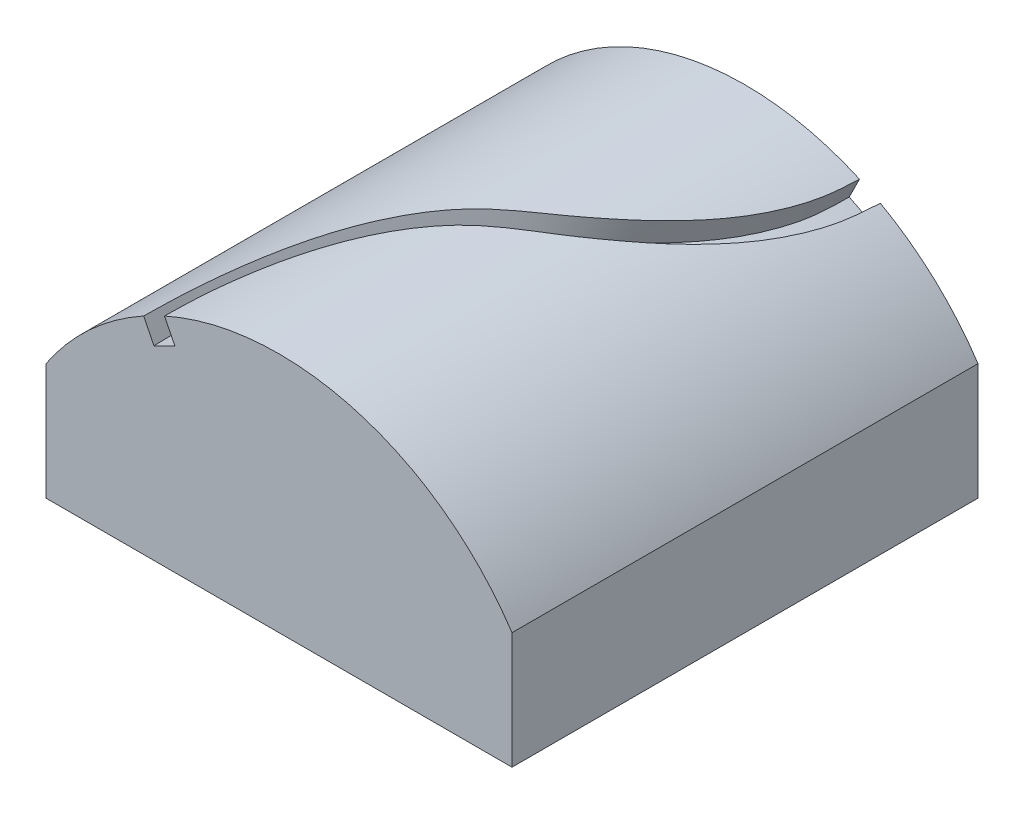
ISO-10303-21;
HEADER;
FILE_DESCRIPTION(('STEP AP214'),'2;1');
FILE_NAME('part.step','',(''),(''),'','','');
FILE_SCHEMA(('AUTOMOTIVE_DESIGN { 1 0 10303 214 1 1 1 1 }'));
ENDSEC;
DATA;
#1=APPLICATION_CONTEXT('core data for automotive mechanical design processes');
#2=APPLICATION_PROTOCOL_DEFINITION('international standard','automotive_design',2000,#1);
#3=PRODUCT_CONTEXT('',#1,'mechanical');
#4=PRODUCT('Part','Part','',(#3));
#5=PRODUCT_RELATED_PRODUCT_CATEGORY('part','',(#4));
#6=PRODUCT_DEFINITION_FORMATION('','',#4);
#7=PRODUCT_DEFINITION_CONTEXT('part definition',#1,'design');
#8=PRODUCT_DEFINITION('design','',#6,#7);
#9=PRODUCT_DEFINITION_SHAPE('','',#8);
#10=(LENGTH_UNIT() NAMED_UNIT(*) SI_UNIT(.MILLI.,.METRE.));
#11=(NAMED_UNIT(*) PLANE_ANGLE_UNIT() SI_UNIT($,.RADIAN.));
#12=(NAMED_UNIT(*) SI_UNIT($,.STERADIAN.) SOLID_ANGLE_UNIT());
#13=UNCERTAINTY_MEASURE_WITH_UNIT(LENGTH_MEASURE(1.E-05),#10,'distance_accuracy_value','');
#14=(GEOMETRIC_REPRESENTATION_CONTEXT(3) GLOBAL_UNCERTAINTY_ASSIGNED_CONTEXT((#13)) GLOBAL_UNIT_ASSIGNED_CONTEXT((#10,
#11,#12)) REPRESENTATION_CONTEXT('',''));
#15=CARTESIAN_POINT('',(0.,0.,0.));
#16=DIRECTION('',(0.,0.,1.));
#17=DIRECTION('',(1.,0.,0.));
#18=AXIS2_PLACEMENT_3D('',#15,#16,#17);
#19=CARTESIAN_POINT('',(0.,-16.332495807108,100.));
#20=DIRECTION('',(0.,0.,-1.));
#21=DIRECTION('',(-1.,0.,0.));
#22=AXIS2_PLACEMENT_3D('',#19,#20,#21);
#23=CYLINDRICAL_SURFACE('',#22,120.);
#24=CARTESIAN_POINT('',(0.,-16.332495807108,-100.));
#25=DIRECTION('',(0.,0.,1.));
#26=DIRECTION('',(1.,0.,0.));
#27=AXIS2_PLACEMENT_3D('',#24,#25,#26);
#28=CIRCLE('',#27,120.);
#29=CARTESIAN_POINT('',(100.,50.,-100.));
#30=VERTEX_POINT('',#29);
#31=CARTESIAN_POINT('',(58.0929945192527,88.6684755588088,-100.));
#32=VERTEX_POINT('',#31);
#33=EDGE_CURVE('E868',#30,#32,#28,.T.);
#34=ORIENTED_EDGE('',*,*,#33,.T.);
#35=CARTESIAN_POINT('',(58.0929945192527,88.6684755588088,-100.));
#36=CARTESIAN_POINT('',(58.0395796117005,88.6980010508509,-98.656311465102));
#37=CARTESIAN_POINT('',(57.9863529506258,88.7274199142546,-97.3124127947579));
#38=CARTESIAN_POINT('',(57.8664859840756,88.7935054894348,-94.6246568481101));
#39=CARTESIAN_POINT('',(57.7998380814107,88.8301763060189,-93.2808000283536));
#40=CARTESIAN_POINT('',(57.6795057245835,88.8961906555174,-91.2668779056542));
#41=CARTESIAN_POINT('',(57.6360151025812,88.9200227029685,-90.5960505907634));
#42=CARTESIAN_POINT('',(57.5404992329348,88.9722713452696,-89.2551733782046));
#43=CARTESIAN_POINT('',(57.4884739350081,89.0006879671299,-88.5851234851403));
#44=CARTESIAN_POINT('',(57.3741788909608,89.0629871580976,-87.246663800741));
#45=CARTESIAN_POINT('',(57.3119172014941,89.096865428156,-86.5782531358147));
#46=CARTESIAN_POINT('',(57.2095300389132,89.1524375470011,-85.576829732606));
#47=CARTESIAN_POINT('',(57.1739019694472,89.1717539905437,-85.2432214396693));
#48=CARTESIAN_POINT('',(57.0994032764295,89.2120916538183,-84.5764692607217));
#49=CARTESIAN_POINT('',(57.0605326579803,89.2331128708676,-84.2433253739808));
#50=CARTESIAN_POINT('',(56.9795056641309,89.2768695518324,-83.5775963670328));
#51=CARTESIAN_POINT('',(56.9373497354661,89.2996047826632,-83.2450111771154));
#52=CARTESIAN_POINT('',(56.8498383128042,89.3467280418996,-82.5803800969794));
#53=CARTESIAN_POINT('',(56.8044828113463,89.3711160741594,-82.2483342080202));
#54=CARTESIAN_POINT('',(56.6637039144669,89.4466893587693,-81.2530346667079));
#55=CARTESIAN_POINT('',(56.563568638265,89.5002835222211,-80.5906233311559));
#56=CARTESIAN_POINT('',(56.350027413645,89.6141380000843,-79.2605888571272));
#57=CARTESIAN_POINT('',(56.2364810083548,89.6744684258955,-78.5929943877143));
#58=CARTESIAN_POINT('',(55.9975924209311,89.8008538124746,-77.2604707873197));
#59=CARTESIAN_POINT('',(55.8722503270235,89.8669087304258,-76.5955416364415));
#60=CARTESIAN_POINT('',(55.6102755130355,90.0043234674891,-75.2684237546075));
#61=CARTESIAN_POINT('',(55.4736421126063,90.075683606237,-74.6062351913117));
#62=CARTESIAN_POINT('',(55.1895964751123,90.2232832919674,-73.2847209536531));
#63=CARTESIAN_POINT('',(55.0421842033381,90.2995228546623,-72.6253952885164));
#64=CARTESIAN_POINT('',(54.7370139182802,90.4564958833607,-71.3094936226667));
#65=CARTESIAN_POINT('',(54.5792531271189,90.5372305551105,-70.6529184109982));
#66=CARTESIAN_POINT('',(54.2539529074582,90.7027409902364,-69.34270875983));
#67=CARTESIAN_POINT('',(54.0864134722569,90.7875167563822,-68.6890743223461));
#68=CARTESIAN_POINT('',(53.7416361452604,90.9609047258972,-67.384743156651));
#69=CARTESIAN_POINT('',(53.5643964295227,91.0495176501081,-66.7340470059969));
#70=CARTESIAN_POINT('',(53.2001521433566,91.2304398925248,-65.4359180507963));
#71=CARTESIAN_POINT('',(53.0131476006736,91.3227492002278,-64.7884852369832));
#72=CARTESIAN_POINT('',(52.4373924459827,91.6049990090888,-62.8512844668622));
#73=CARTESIAN_POINT('',(52.0339053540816,91.8002588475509,-61.5666332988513));
#74=CARTESIAN_POINT('',(51.1864056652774,92.2040076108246,-59.010230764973));
#75=CARTESIAN_POINT('',(50.7423212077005,92.4125197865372,-57.7385068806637));
#76=CARTESIAN_POINT('',(50.0459661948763,92.7338442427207,-55.8436494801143));
#77=CARTESIAN_POINT('',(49.8088264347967,92.8423709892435,-55.2141928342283));
#78=CARTESIAN_POINT('',(49.3244058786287,93.0620823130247,-53.9596613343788));
#79=CARTESIAN_POINT('',(49.0771250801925,93.1732668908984,-53.3345864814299));
#80=CARTESIAN_POINT('',(48.320324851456,93.5103521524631,-51.4663580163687));
#81=CARTESIAN_POINT('',(47.7957419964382,93.7398332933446,-50.22991321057));
#82=CARTESIAN_POINT('',(46.7073412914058,94.2060706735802,-47.7762157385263));
#83=CARTESIAN_POINT('',(46.1435329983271,94.442825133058,-46.5589584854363));
#84=CARTESIAN_POINT('',(44.9774700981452,94.9213768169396,-44.1445352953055));
#85=CARTESIAN_POINT('',(44.375228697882,95.1631722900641,-42.9473626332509));
#86=CARTESIAN_POINT('',(43.1380837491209,95.6476069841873,-40.5833606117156));
#87=CARTESIAN_POINT('',(42.5034957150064,95.8902222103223,-39.4163611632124));
#88=CARTESIAN_POINT('',(41.1972975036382,96.3762806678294,-37.103411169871));
#89=CARTESIAN_POINT('',(40.5256867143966,96.6197239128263,-35.9574609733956));
#90=CARTESIAN_POINT('',(39.145335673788,97.1054966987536,-33.6874127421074));
#91=CARTESIAN_POINT('',(38.4365843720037,97.3478258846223,-32.5633213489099));
#92=CARTESIAN_POINT('',(36.9818703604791,97.8293574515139,-30.3377617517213));
#93=CARTESIAN_POINT('',(36.2358848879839,98.0685578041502,-29.236307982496));
#94=CARTESIAN_POINT('',(34.7065400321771,98.5417705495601,-27.0568533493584));
#95=CARTESIAN_POINT('',(33.9231449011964,98.7757776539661,-25.9788764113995));
#96=CARTESIAN_POINT('',(32.4205286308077,99.2072908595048,-23.9799577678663));
#97=CARTESIAN_POINT('',(31.7054069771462,99.4057230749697,-23.0561284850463));
#98=CARTESIAN_POINT('',(30.2489391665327,99.7948907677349,-21.2273787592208));
#99=CARTESIAN_POINT('',(29.5075876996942,99.9856246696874,-20.3224622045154));
#100=CARTESIAN_POINT('',(28.3768467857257,100.264696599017,-18.9796731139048));
#101=CARTESIAN_POINT('',(27.9968686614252,100.356536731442,-18.534568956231));
#102=CARTESIAN_POINT('',(27.2307345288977,100.537697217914,-17.649184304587));
#103=CARTESIAN_POINT('',(26.8445785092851,100.627017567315,-17.2089038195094));
#104=CARTESIAN_POINT('',(26.0665550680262,100.802868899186,-16.3335142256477));
#105=CARTESIAN_POINT('',(25.6746925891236,100.889402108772,-15.8984011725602));
#106=CARTESIAN_POINT('',(24.884904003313,101.059602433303,-15.0331559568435));
#107=CARTESIAN_POINT('',(24.4869779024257,101.143269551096,-14.6030237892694));
#108=CARTESIAN_POINT('',(23.284709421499,101.389597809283,-13.3217327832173));
#109=CARTESIAN_POINT('',(22.470877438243,101.547812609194,-12.4785520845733));
#110=CARTESIAN_POINT('',(21.2307297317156,101.775218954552,-11.2325968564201));
#111=CARTESIAN_POINT('',(20.8144231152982,101.849318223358,-10.8207066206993));
#112=CARTESIAN_POINT('',(19.9749852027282,101.994092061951,-10.0033131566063));
#113=CARTESIAN_POINT('',(19.5518538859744,102.064766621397,-9.59780994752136));
#114=CARTESIAN_POINT('',(18.6946643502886,102.203151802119,-8.78979848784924));
#115=CARTESIAN_POINT('',(18.2605410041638,102.270828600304,-8.3873535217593));
#116=CARTESIAN_POINT('',(17.3851177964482,102.402307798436,-7.58970340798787));
#117=CARTESIAN_POINT('',(16.943817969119,102.466110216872,-7.19449822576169));
#118=CARTESIAN_POINT('',(16.0540281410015,102.589621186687,-6.41170588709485));
#119=CARTESIAN_POINT('',(15.6055389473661,102.649330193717,-6.02411788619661));
#120=CARTESIAN_POINT('',(14.9273340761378,102.735663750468,-5.44871200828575));
#121=CARTESIAN_POINT('',(14.7003528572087,102.76390340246,-5.25790518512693));
#122=CARTESIAN_POINT('',(14.2446377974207,102.819268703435,-4.87823242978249));
#123=CARTESIAN_POINT('',(14.0159039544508,102.846394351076,-4.68936649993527));
#124=CARTESIAN_POINT('',(13.3269922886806,102.926068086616,-4.12524550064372));
#125=CARTESIAN_POINT('',(12.8643858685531,102.976877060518,-3.75270555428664));
#126=CARTESIAN_POINT('',(11.9336383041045,103.073564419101,-3.01396162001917));
#127=CARTESIAN_POINT('',(11.4654971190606,103.119442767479,-2.64775767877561));
#128=CARTESIAN_POINT('',(10.5240315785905,103.206068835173,-1.92038852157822));
#129=CARTESIAN_POINT('',(10.0507021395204,103.246810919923,-1.55922921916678));
#130=CARTESIAN_POINT('',(9.10017840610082,103.322901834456,-0.841470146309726));
#131=CARTESIAN_POINT('',(8.62298412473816,103.358250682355,-0.484870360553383));
#132=CARTESIAN_POINT('',(7.18576904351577,103.456013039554,0.580160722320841));
#133=CARTESIAN_POINT('',(6.22108471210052,103.510052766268,1.28308144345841));
#134=CARTESIAN_POINT('',(4.28478652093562,103.594900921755,2.68200369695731));
#135=CARTESIAN_POINT('',(3.31316855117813,103.625694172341,3.37800041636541));
#136=CARTESIAN_POINT('',(1.38493726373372,103.663326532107,4.76009852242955));
#137=CARTESIAN_POINT('',(0.428322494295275,103.670525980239,5.44618786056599));
#138=CARTESIAN_POINT('',(-1.47751394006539,103.66218905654,6.82726270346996));
#139=CARTESIAN_POINT('',(-2.42673971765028,103.646666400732,7.52224259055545));
#140=CARTESIAN_POINT('',(-4.30969681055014,103.593782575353,8.93003589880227));
#141=CARTESIAN_POINT('',(-5.24344462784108,103.556446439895,9.64282798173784));
#142=CARTESIAN_POINT('',(-6.62668573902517,103.485284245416,10.7320362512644));
#143=CARTESIAN_POINT('',(-7.08462537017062,103.45905553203,11.0982380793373));
#144=CARTESIAN_POINT('',(-7.99390735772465,103.401813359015,11.8383816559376));
#145=CARTESIAN_POINT('',(-8.44524979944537,103.370799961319,12.2123233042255));
#146=CARTESIAN_POINT('',(-9.34023727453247,103.30429376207,12.9685074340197));
#147=CARTESIAN_POINT('',(-9.78388574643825,103.268803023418,13.350746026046));
#148=CARTESIAN_POINT('',(-10.6639024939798,103.193552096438,14.1230978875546));
#149=CARTESIAN_POINT('',(-11.1002706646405,103.153791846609,14.5132112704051));
#150=CARTESIAN_POINT('',(-12.3988483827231,103.028407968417,15.6947973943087));
#151=CARTESIAN_POINT('',(-13.2503898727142,102.936691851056,16.4973963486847));
#152=CARTESIAN_POINT('',(-14.9181540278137,102.739528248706,18.1210310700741));
#153=CARTESIAN_POINT('',(-15.7346356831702,102.634219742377,18.9418187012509));
#154=CARTESIAN_POINT('',(-17.3430817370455,102.41041110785,20.6078095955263));
#155=CARTESIAN_POINT('',(-18.13500567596,102.291890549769,21.4530491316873));
#156=CARTESIAN_POINT('',(-19.6948783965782,102.042906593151,23.1655560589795));
#157=CARTESIAN_POINT('',(-20.4627965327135,101.912428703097,24.0328492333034));
#158=CARTESIAN_POINT('',(-21.9732396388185,101.641086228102,25.7888501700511));
#159=CARTESIAN_POINT('',(-22.7157449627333,101.500213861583,26.6775736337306));
#160=CARTESIAN_POINT('',(-24.1739596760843,101.209720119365,28.4757637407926));
#161=CARTESIAN_POINT('',(-24.889661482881,101.060096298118,29.3852361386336));
#162=CARTESIAN_POINT('',(-26.2930232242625,100.753765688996,31.2241216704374));
#163=CARTESIAN_POINT('',(-26.9806883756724,100.59706023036,32.1535310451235));
#164=CARTESIAN_POINT('',(-28.4065660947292,100.259379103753,34.142682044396));
#165=CARTESIAN_POINT('',(-29.1411921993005,100.077718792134,35.2048808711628));
#166=CARTESIAN_POINT('',(-30.5733854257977,99.7097991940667,37.3517585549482));
#167=CARTESIAN_POINT('',(-31.2709856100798,99.5235442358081,38.4364161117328));
#168=CARTESIAN_POINT('',(-32.629051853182,99.1484158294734,40.6274020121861));
#169=CARTESIAN_POINT('',(-33.2895391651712,98.9595439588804,41.7337174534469));
#170=CARTESIAN_POINT('',(-34.5731785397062,98.5811366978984,43.9672697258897));
#171=CARTESIAN_POINT('',(-35.1963408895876,98.3916015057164,45.0945006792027));
#172=CARTESIAN_POINT('',(-36.4049781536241,98.0138133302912,47.369236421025));
#173=CARTESIAN_POINT('',(-36.9904522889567,97.8255603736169,48.5167416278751));
#174=CARTESIAN_POINT('',(-38.1270076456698,97.4510353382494,50.8396910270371));
#175=CARTESIAN_POINT('',(-38.6778035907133,97.2647880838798,52.0152788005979));
#176=CARTESIAN_POINT('',(-39.7395452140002,96.8977305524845,54.3856488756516));
#177=CARTESIAN_POINT('',(-40.2504781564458,96.7169220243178,55.5804371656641));
#178=CARTESIAN_POINT('',(-40.9861335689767,96.451389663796,57.3860567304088));
#179=CARTESIAN_POINT('',(-41.2262528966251,96.3638162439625,57.9902370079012));
#180=CARTESIAN_POINT('',(-41.6961159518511,96.1908199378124,59.2029248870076));
#181=CARTESIAN_POINT('',(-41.9258596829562,96.1053970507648,59.8114324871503));
#182=CARTESIAN_POINT('',(-42.5996224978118,95.852630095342,61.6432439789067));
#183=CARTESIAN_POINT('',(-43.0281457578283,95.6887976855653,62.8727691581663));
#184=CARTESIAN_POINT('',(-43.8440906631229,95.3719681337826,65.346739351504));
#185=CARTESIAN_POINT('',(-44.2315129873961,95.2189708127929,66.5911841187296));
#186=CARTESIAN_POINT('',(-44.7515712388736,95.0107751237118,68.3640456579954));
#187=CARTESIAN_POINT('',(-44.901078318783,94.9505574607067,68.8869757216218));
#188=CARTESIAN_POINT('',(-45.1930061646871,94.8323233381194,69.9350616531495));
#189=CARTESIAN_POINT('',(-45.335426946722,94.7743068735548,70.4602175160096));
#190=CARTESIAN_POINT('',(-45.6132074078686,94.6605572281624,71.5125586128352));
#191=CARTESIAN_POINT('',(-45.7485681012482,94.6048237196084,72.0397435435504));
#192=CARTESIAN_POINT('',(-46.0121352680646,94.4957665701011,73.0961408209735));
#193=CARTESIAN_POINT('',(-46.140341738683,94.442442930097,73.6253531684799));
#194=CARTESIAN_POINT('',(-46.5136482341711,94.2864595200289,75.2157515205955));
#195=CARTESIAN_POINT('',(-46.7475180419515,94.1877532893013,76.2800108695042));
#196=CARTESIAN_POINT('',(-47.0738504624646,94.0489635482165,77.8820184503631));
#197=CARTESIAN_POINT('',(-47.1785407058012,94.004248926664,78.4169078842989));
#198=CARTESIAN_POINT('',(-47.3794348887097,93.91813274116,79.4885541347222));
#199=CARTESIAN_POINT('',(-47.4756388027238,93.8767311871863,80.0253109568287));
#200=CARTESIAN_POINT('',(-47.6592201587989,93.7974671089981,81.1006534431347));
#201=CARTESIAN_POINT('',(-47.746596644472,93.7596049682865,81.639239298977));
#202=CARTESIAN_POINT('',(-47.9121501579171,93.6876569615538,82.7180735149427));
#203=CARTESIAN_POINT('',(-47.9903272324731,93.6535710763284,83.258321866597));
#204=CARTESIAN_POINT('',(-48.1363902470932,93.5897231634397,84.3348941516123));
#205=CARTESIAN_POINT('',(-48.2043721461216,93.5599209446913,84.8712026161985));
#206=CARTESIAN_POINT('',(-48.2990218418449,93.5183379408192,85.6766791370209));
#207=CARTESIAN_POINT('',(-48.3293513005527,93.504996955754,85.9453411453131));
#208=CARTESIAN_POINT('',(-48.3876009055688,93.4793482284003,86.4829756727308));
#209=CARTESIAN_POINT('',(-48.415521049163,93.4670404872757,86.7519481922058));
#210=CARTESIAN_POINT('',(-48.4959182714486,93.4315664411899,87.5594375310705));
#211=CARTESIAN_POINT('',(-48.5450125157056,93.4098579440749,88.0983577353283));
#212=CARTESIAN_POINT('',(-48.6352783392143,93.3698839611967,89.1769846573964));
#213=CARTESIAN_POINT('',(-48.6764498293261,93.3516185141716,89.7166913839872));
#214=CARTESIAN_POINT('',(-48.7520227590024,93.3180490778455,90.7970439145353));
#215=CARTESIAN_POINT('',(-48.7864194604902,93.3027471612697,91.3376901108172));
#216=CARTESIAN_POINT('',(-48.8495334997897,93.2746400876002,92.4193717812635));
#217=CARTESIAN_POINT('',(-48.8782508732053,93.2618349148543,92.9604072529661));
#218=CARTESIAN_POINT('',(-48.9575981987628,93.2264250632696,94.5842833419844));
#219=CARTESIAN_POINT('',(-49.0013981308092,93.206837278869,95.6675099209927));
#220=CARTESIAN_POINT('',(-49.0797661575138,93.1717403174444,97.8338577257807));
#221=CARTESIAN_POINT('',(-49.1143386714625,93.1562291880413,98.9169787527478));
#222=CARTESIAN_POINT('',(-49.1488006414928,93.1407675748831,100.));
#223=B_SPLINE_CURVE_WITH_KNOTS('',3,(#35,#36,#37,#38,#39,#40,#41,#42,#43,#44,#45,#46,#47,#48,
#49,#50,#51,#52,#53,#54,#55,#56,#57,#58,#59,#60,#61,#62,#63,#64,#65,#66,#67,#68,#69,#70,#71,#72,
#73,#74,#75,#76,#77,#78,#79,#80,#81,#82,#83,#84,#85,#86,#87,#88,#89,#90,#91,#92,#93,#94,#95,#96,
#97,#98,#99,#100,#101,#102,#103,#104,#105,#106,#107,#108,#109,#110,#111,#112,#113,#114,#115,
#116,#117,#118,#119,#120,#121,#122,#123,#124,#125,#126,#127,#128,#129,#130,#131,#132,#133,#134,
#135,#136,#137,#138,#139,#140,#141,#142,#143,#144,#145,#146,#147,#148,#149,#150,#151,#152,#153,
#154,#155,#156,#157,#158,#159,#160,#161,#162,#163,#164,#165,#166,#167,#168,#169,#170,#171,#172,
#173,#174,#175,#176,#177,#178,#179,#180,#181,#182,#183,#184,#185,#186,#187,#188,#189,#190,#191,
#192,#193,#194,#195,#196,#197,#198,#199,#200,#201,#202,#203,#204,#205,#206,#207,#208,#209,#210,
#211,#212,#213,#214,#215,#216,#217,#218,#219,#220,#221,#222),.UNSPECIFIED.,.F.,.F.,(4,2,2,2,2,2,
2,2,2,2,2,2,2,2,2,2,2,2,2,2,2,2,2,2,2,2,2,2,2,2,2,2,2,2,2,2,2,2,2,2,2,2,2,2,2,2,2,2,2,2,2,2,2,2,
2,2,2,2,2,2,2,2,2,2,2,2,2,2,2,2,2,2,2,2,2,2,2,2,2,2,2,2,2,2,2,2,2,2,2,2,2,2,2,4),(0.,
4.03557165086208,8.07343411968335,10.0913442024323,12.109266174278,14.1256074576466,
15.1337736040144,16.141938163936,17.1499658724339,18.157995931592,20.1740687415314,
22.2135263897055,24.2529687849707,26.2925341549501,28.3321060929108,30.3722277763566,
32.4123508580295,34.4528588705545,36.4933610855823,40.574425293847,44.6628586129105,
46.7068057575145,48.7507533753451,52.8377191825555,56.9236926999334,61.0082696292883,
65.0586642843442,69.1091259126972,73.1607995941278,77.2149813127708,81.2731178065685,
84.8276844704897,88.3829748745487,90.1601229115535,91.9372742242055,93.7129683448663,
95.4886607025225,99.0354763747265,100.806314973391,102.577158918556,104.364532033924,
106.151896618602,107.939061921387,108.832652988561,109.726245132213,111.514541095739,
113.302850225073,115.093104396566,116.883352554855,120.467518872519,124.054023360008,
127.585490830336,131.114827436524,134.640121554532,136.400857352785,138.161570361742,
139.921475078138,141.681405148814,145.201821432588,148.688736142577,152.181119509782,
155.67779285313,159.177110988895,162.677411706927,166.177058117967,170.088910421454,
173.997208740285,177.903245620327,181.808200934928,185.713236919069,189.647052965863,
193.582120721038,195.550089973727,197.518058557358,201.454215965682,205.390308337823,
207.031884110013,208.67345616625,210.314791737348,211.956127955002,215.237826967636,
216.878374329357,218.51892663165,220.159656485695,221.800377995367,223.424529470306,
224.236610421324,225.048692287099,226.673365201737,228.298056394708,229.923879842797,
231.549693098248,234.80247348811,238.053693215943),.UNSPECIFIED.);
#224=CARTESIAN_POINT('',(-49.1488006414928,93.1407675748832,100.));
#225=VERTEX_POINT('',#224);
#226=EDGE_CURVE('E878',#32,#225,#223,.T.);
#227=ORIENTED_EDGE('',*,*,#226,.T.);
#228=CARTESIAN_POINT('',(0.,-16.332495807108,100.));
#229=DIRECTION('',(0.,0.,1.));
#230=DIRECTION('',(1.,0.,0.));
#231=AXIS2_PLACEMENT_3D('',#228,#229,#230);
#232=CIRCLE('',#231,120.);
#233=CARTESIAN_POINT('',(100.,50.,100.));
#234=VERTEX_POINT('',#233);
#235=EDGE_CURVE('E870',#234,#225,#232,.T.);
#236=ORIENTED_EDGE('',*,*,#235,.F.);
#237=DIRECTION('',(0.,0.,-1.));
#238=VECTOR('',#237,1.);
#239=CARTESIAN_POINT('',(100.,50.,100.));
#240=LINE('',#239,#238);
#241=EDGE_CURVE('E858',#234,#30,#240,.T.);
#242=ORIENTED_EDGE('',*,*,#241,.T.);
#243=EDGE_LOOP('',(#34,#227,#236,#242));
#244=FACE_BOUND('',#243,.T.);
#245=ADVANCED_FACE('F779',(#244),#23,.T.);
#246=CARTESIAN_POINT('',(-58.0929945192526,88.6684755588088,100.));
#247=VERTEX_POINT('',#246);
#248=CARTESIAN_POINT('',(-100.,50.,100.));
#249=VERTEX_POINT('',#248);
#250=EDGE_CURVE('E863',#247,#249,#232,.T.);
#251=ORIENTED_EDGE('',*,*,#250,.F.);
#252=CARTESIAN_POINT('',(-58.0929945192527,88.6684755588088,100.));
#253=CARTESIAN_POINT('',(-58.039580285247,88.6980006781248,98.6563110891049));
#254=CARTESIAN_POINT('',(-57.9863542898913,88.7274191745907,97.3124120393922));
#255=CARTESIAN_POINT('',(-57.8664885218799,88.7935040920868,94.6246555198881));
#256=CARTESIAN_POINT('',(-57.7998411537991,88.830174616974,93.2807985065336));
#257=CARTESIAN_POINT('',(-57.6795094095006,88.8961886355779,91.2668761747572));
#258=CARTESIAN_POINT('',(-57.6360189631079,88.92002058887,90.5960488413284));
#259=CARTESIAN_POINT('',(-57.5405033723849,88.9722690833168,89.2551715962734));
#260=CARTESIAN_POINT('',(-57.4884781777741,89.0006856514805,88.5851216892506));
#261=CARTESIAN_POINT('',(-57.3741832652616,89.0629847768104,87.2466620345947));
#262=CARTESIAN_POINT('',(-57.3119216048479,89.0968630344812,86.5782514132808));
#263=CARTESIAN_POINT('',(-57.2095344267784,89.1524351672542,85.5768280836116));
#264=CARTESIAN_POINT('',(-57.1739063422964,89.1717516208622,85.2432198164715));
#265=CARTESIAN_POINT('',(-57.0994075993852,89.2120893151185,84.5764676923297));
#266=CARTESIAN_POINT('',(-57.0605369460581,89.2331105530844,84.2433238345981));
#267=CARTESIAN_POINT('',(-56.9795098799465,89.2768672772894,83.5775948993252));
#268=CARTESIAN_POINT('',(-56.937353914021,89.2996025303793,83.2450097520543));
#269=CARTESIAN_POINT('',(-56.8498424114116,89.3467258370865,82.5803787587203));
#270=CARTESIAN_POINT('',(-56.804486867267,89.3711138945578,82.2483329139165));
#271=CARTESIAN_POINT('',(-56.6637078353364,89.4466872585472,81.2530335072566));
#272=CARTESIAN_POINT('',(-56.5635724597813,89.5002814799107,80.5906222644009));
#273=CARTESIAN_POINT('',(-56.3500309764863,89.6141361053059,79.2605877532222));
#274=CARTESIAN_POINT('',(-56.2364844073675,89.674466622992,78.5929931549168));
#275=CARTESIAN_POINT('',(-55.9975954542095,89.8008522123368,77.2604693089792));
#276=CARTESIAN_POINT('',(-55.8722531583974,89.8669072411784,76.5955400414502));
#277=CARTESIAN_POINT('',(-55.6102778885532,90.0043222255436,75.2684219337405));
#278=CARTESIAN_POINT('',(-55.4736442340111,90.0756825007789,74.6062332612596));
#279=CARTESIAN_POINT('',(-55.1895980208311,90.2232824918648,73.284718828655));
#280=CARTESIAN_POINT('',(-55.0421854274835,90.2995222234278,72.6253930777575));
#281=CARTESIAN_POINT('',(-54.7370144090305,90.4564956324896,71.3094912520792));
#282=CARTESIAN_POINT('',(-54.5792532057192,90.5372305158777,70.6529159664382));
#283=CARTESIAN_POINT('',(-54.2539520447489,90.7027414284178,69.3427062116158));
#284=CARTESIAN_POINT('',(-54.0864120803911,90.7875174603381,68.6890717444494));
#285=CARTESIAN_POINT('',(-53.74163358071,90.9609060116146,67.3847405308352));
#286=CARTESIAN_POINT('',(-53.564393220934,91.049519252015,66.7340443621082));
#287=CARTESIAN_POINT('',(-53.2001475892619,91.2304421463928,65.435915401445));
#288=CARTESIAN_POINT('',(-53.0131423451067,91.3227517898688,64.7884826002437));
#289=CARTESIAN_POINT('',(-52.4373850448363,91.6050026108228,62.8512818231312));
#290=CARTESIAN_POINT('',(-52.0338964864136,91.800263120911,61.5666306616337));
#291=CARTESIAN_POINT('',(-51.1863944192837,92.204012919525,59.0102286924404));
#292=CARTESIAN_POINT('',(-50.7423090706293,92.4125254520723,57.7385053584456));
#293=CARTESIAN_POINT('',(-50.0459533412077,92.7338501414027,55.8436485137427));
#294=CARTESIAN_POINT('',(-49.8088134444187,92.8423769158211,55.2141920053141));
#295=CARTESIAN_POINT('',(-49.3243928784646,93.0620881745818,53.9596606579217));
#296=CARTESIAN_POINT('',(-49.077112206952,93.1732726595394,53.3345858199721));
#297=CARTESIAN_POINT('',(-48.3203126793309,93.5103575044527,51.4663572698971));
#298=CARTESIAN_POINT('',(-47.7957307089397,93.7398381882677,50.2299122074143));
#299=CARTESIAN_POINT('',(-46.707332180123,94.2060745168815,47.776214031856));
#300=CARTESIAN_POINT('',(-46.1435251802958,94.442828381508,46.5589563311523));
#301=CARTESIAN_POINT('',(-44.9774648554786,94.9213789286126,44.1445322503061));
#302=CARTESIAN_POINT('',(-44.3752247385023,95.1631738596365,42.947359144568));
#303=CARTESIAN_POINT('',(-43.1380818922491,95.6476076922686,40.5833565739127));
#304=CARTESIAN_POINT('',(-42.5034946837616,95.8902225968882,39.4163570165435));
#305=CARTESIAN_POINT('',(-41.197297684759,96.376280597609,37.1034070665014));
#306=CARTESIAN_POINT('',(-40.5256872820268,96.6197237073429,35.9574570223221));
#307=CARTESIAN_POINT('',(-39.1453367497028,97.1054963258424,33.6874092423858));
#308=CARTESIAN_POINT('',(-38.436585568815,97.3478254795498,32.5633181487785));
#309=CARTESIAN_POINT('',(-36.9818716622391,97.8293570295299,30.3377592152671));
#310=CARTESIAN_POINT('',(-36.2358861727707,98.0685573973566,29.23630581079));
#311=CARTESIAN_POINT('',(-34.7065412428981,98.5417701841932,27.0568519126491));
#312=CARTESIAN_POINT('',(-33.9231460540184,98.7757773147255,25.9788753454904));
#313=CARTESIAN_POINT('',(-32.4205279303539,99.2072910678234,23.9799550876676));
#314=CARTESIAN_POINT('',(-31.7054044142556,99.4057237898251,23.0561238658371));
#315=CARTESIAN_POINT('',(-30.2489327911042,99.7948924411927,21.2273703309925));
#316=CARTESIAN_POINT('',(-29.507579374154,99.9856267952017,20.3224519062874));
#317=CARTESIAN_POINT('',(-28.3768354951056,100.264699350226,18.9796600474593));
#318=CARTESIAN_POINT('',(-27.9968563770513,100.356539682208,18.5345549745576));
#319=CARTESIAN_POINT('',(-27.2307202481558,100.537700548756,17.6491684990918));
#320=CARTESIAN_POINT('',(-26.8445632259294,100.627021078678,17.2088871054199));
#321=CARTESIAN_POINT('',(-26.0665377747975,100.802872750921,16.3334957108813));
#322=CARTESIAN_POINT('',(-25.6746742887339,100.889406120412,15.8983817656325));
#323=CARTESIAN_POINT('',(-24.8848837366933,101.059606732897,15.0331347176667));
#324=CARTESIAN_POINT('',(-24.4869566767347,101.143273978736,14.6030016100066));
#325=CARTESIAN_POINT('',(-23.2846853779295,101.389602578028,13.3217077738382));
#326=CARTESIAN_POINT('',(-22.4708515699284,101.547817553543,12.4785251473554));
#327=CARTESIAN_POINT('',(-21.2307011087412,101.775224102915,11.2325670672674));
#328=CARTESIAN_POINT('',(-20.8143935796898,101.849323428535,10.8206758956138));
#329=CARTESIAN_POINT('',(-19.9749538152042,101.99409736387,10.0032805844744));
#330=CARTESIAN_POINT('',(-19.5518215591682,102.064771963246,9.5977764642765));
#331=CARTESIAN_POINT('',(-18.6946300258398,102.203157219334,8.78976314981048));
#332=CARTESIAN_POINT('',(-18.2605056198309,102.27083405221,8.38731724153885));
#333=CARTESIAN_POINT('',(-17.3850802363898,102.402313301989,7.58966530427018));
#334=CARTESIAN_POINT('',(-16.9437792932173,102.466115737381,7.19445924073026));
#335=CARTESIAN_POINT('',(-16.0539871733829,102.589626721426,6.4116652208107));
#336=CARTESIAN_POINT('',(-15.6054968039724,102.649335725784,6.02407641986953));
#337=CARTESIAN_POINT('',(-14.9272901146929,102.735669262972,5.44866940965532));
#338=CARTESIAN_POINT('',(-14.7003082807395,102.763908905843,5.25786222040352));
#339=CARTESIAN_POINT('',(-14.2445919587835,102.81927418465,4.87818877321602));
#340=CARTESIAN_POINT('',(-14.0158574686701,102.846399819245,4.68932251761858));
#341=CARTESIAN_POINT('',(-13.3269438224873,102.926073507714,4.12520058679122));
#342=CARTESIAN_POINT('',(-12.8643360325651,102.976882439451,3.75266008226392));
#343=CARTESIAN_POINT('',(-11.9335856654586,103.073569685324,3.01391512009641));
#344=CARTESIAN_POINT('',(-11.4654430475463,103.119447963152,2.6477107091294));
#345=CARTESIAN_POINT('',(-10.5239746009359,103.206073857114,1.92034065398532));
#346=CARTESIAN_POINT('',(-10.0506436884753,103.246815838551,1.55918092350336));
#347=CARTESIAN_POINT('',(-9.10011700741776,103.32290650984,0.84142100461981));
#348=CARTESIAN_POINT('',(-8.62292125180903,103.35825521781,0.484820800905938));
#349=CARTESIAN_POINT('',(-7.18570177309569,103.456017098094,-0.580211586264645));
#350=CARTESIAN_POINT('',(-6.22101455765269,103.51005642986,-1.28313323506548));
#351=CARTESIAN_POINT('',(-4.28471093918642,103.594903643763,-2.68205778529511));
#352=CARTESIAN_POINT('',(-3.31309042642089,103.625696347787,-3.37805587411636));
#353=CARTESIAN_POINT('',(-1.38485473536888,103.663327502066,-4.76015742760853));
#354=CARTESIAN_POINT('',(-0.428238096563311,103.670526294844,-5.44624883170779));
#355=CARTESIAN_POINT('',(1.47760166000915,103.662187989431,-6.82732831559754));
#356=CARTESIAN_POINT('',(2.42682889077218,103.646664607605,-7.522310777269));
#357=CARTESIAN_POINT('',(4.30978864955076,103.593779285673,-8.93010948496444));
#358=CARTESIAN_POINT('',(5.24353767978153,103.556442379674,-9.64290439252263));
#359=CARTESIAN_POINT('',(6.6267805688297,103.485279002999,-10.732116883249));
#360=CARTESIAN_POINT('',(7.08472078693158,103.459049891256,-11.0983201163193));
#361=CARTESIAN_POINT('',(7.99400395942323,103.401806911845,-11.8384664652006));
#362=CARTESIAN_POINT('',(8.44534699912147,103.370793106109,-12.2124094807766));
#363=CARTESIAN_POINT('',(9.34033568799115,103.304286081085,-12.9685962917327));
#364=CARTESIAN_POINT('',(9.78398477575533,103.268794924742,-13.3508361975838));
#365=CARTESIAN_POINT('',(10.6640027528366,103.193543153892,-14.1231906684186));
#366=CARTESIAN_POINT('',(11.1003715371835,103.153782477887,-14.5133053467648));
#367=CARTESIAN_POINT('',(12.3989510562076,103.02839731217,-15.6948953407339));
#368=CARTESIAN_POINT('',(13.2504937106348,102.936680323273,-16.497496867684));
#369=CARTESIAN_POINT('',(14.9182600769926,102.739514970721,-18.1211368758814));
#370=CARTESIAN_POINT('',(15.7347427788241,102.634205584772,-18.9419272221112));
#371=CARTESIAN_POINT('',(17.3431906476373,102.410395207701,-20.6079237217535));
#372=CARTESIAN_POINT('',(18.1351153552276,102.291873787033,-21.453166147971));
#373=CARTESIAN_POINT('',(19.6949893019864,102.042888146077,-23.1656790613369));
#374=CARTESIAN_POINT('',(20.4629078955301,101.912409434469,-24.032975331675));
#375=CARTESIAN_POINT('',(21.9733516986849,101.641065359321,-25.7889825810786));
#376=CARTESIAN_POINT('',(22.7158572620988,101.500192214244,-26.6777092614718));
#377=CARTESIAN_POINT('',(24.1740722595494,101.209696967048,-28.4759059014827));
#378=CARTESIAN_POINT('',(24.8897741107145,101.060072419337,-29.385381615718));
#379=CARTESIAN_POINT('',(26.2931357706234,100.753740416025,-31.2242738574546));
#380=CARTESIAN_POINT('',(26.9808007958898,100.597034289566,-32.1536866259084));
#381=CARTESIAN_POINT('',(28.4066749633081,100.259352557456,-34.1428405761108));
#382=CARTESIAN_POINT('',(29.141297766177,100.077692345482,-35.205038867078));
#383=CARTESIAN_POINT('',(30.5734846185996,99.7097730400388,-37.3519152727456));
#384=CARTESIAN_POINT('',(31.2710817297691,99.523518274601,-38.4365720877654));
#385=CARTESIAN_POINT('',(32.6291422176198,99.1483902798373,-40.6275562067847));
#386=CARTESIAN_POINT('',(33.2896268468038,98.9595186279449,-41.7338706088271));
#387=CARTESIAN_POINT('',(34.573261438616,98.5811117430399,-43.9674203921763));
#388=CARTESIAN_POINT('',(35.1964216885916,98.3915767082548,-45.0946498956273));
#389=CARTESIAN_POINT('',(36.4050554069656,98.0137887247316,-47.3693823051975));
#390=CARTESIAN_POINT('',(36.9905280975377,97.8255358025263,-48.5168856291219));
#391=CARTESIAN_POINT('',(38.1270807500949,97.4510108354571,-50.8398311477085));
#392=CARTESIAN_POINT('',(38.6778754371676,97.2647636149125,-52.0154169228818));
#393=CARTESIAN_POINT('',(39.7396142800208,96.8977063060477,-54.3857830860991));
#394=CARTESIAN_POINT('',(40.250545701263,96.7168979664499,-55.5805694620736));
#395=CARTESIAN_POINT('',(40.9861982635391,96.4513661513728,-57.386186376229));
#396=CARTESIAN_POINT('',(41.2263165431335,96.3637929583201,-57.9903657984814));
#397=CARTESIAN_POINT('',(41.6961772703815,96.190797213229,-59.2030520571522));
#398=CARTESIAN_POINT('',(41.9259197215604,96.1053746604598,-59.8115588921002));
#399=CARTESIAN_POINT('',(42.5996784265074,95.852608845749,-61.6433681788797));
#400=CARTESIAN_POINT('',(43.0281985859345,95.6887773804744,-62.8728920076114));
#401=CARTESIAN_POINT('',(43.8441369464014,95.371949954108,-65.3468595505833));
#402=CARTESIAN_POINT('',(44.2315558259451,95.2189538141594,-66.591303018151));
#403=CARTESIAN_POINT('',(44.7516089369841,95.0107599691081,-68.3641614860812));
#404=CARTESIAN_POINT('',(44.9011142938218,94.9505429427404,-68.8870898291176));
#405=CARTESIAN_POINT('',(45.1930387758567,94.8323100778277,-69.9351722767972));
#406=CARTESIAN_POINT('',(45.3354579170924,94.7742942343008,-70.4603263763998));
#407=CARTESIAN_POINT('',(45.6132352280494,94.6605457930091,-71.5126639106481));
#408=CARTESIAN_POINT('',(45.7485944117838,94.6048128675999,-72.0398470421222));
#409=CARTESIAN_POINT('',(46.0121586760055,94.495756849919,-73.0962406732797));
#410=CARTESIAN_POINT('',(46.1403637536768,94.4424337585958,-73.6254511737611));
#411=CARTESIAN_POINT('',(46.5136662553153,94.2864519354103,-75.2158439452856));
#412=CARTESIAN_POINT('',(46.7475336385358,94.1877466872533,-76.2800994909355));
#413=CARTESIAN_POINT('',(47.0738627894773,94.0489582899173,-77.8821012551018));
#414=CARTESIAN_POINT('',(47.1785520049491,94.0042440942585,-78.4169887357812));
#415=CARTESIAN_POINT('',(47.3794442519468,93.9181287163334,-79.4886310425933));
#416=CARTESIAN_POINT('',(47.4756472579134,93.8767275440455,-80.025385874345));
#417=CARTESIAN_POINT('',(47.6592269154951,93.7974641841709,-81.1007243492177));
#418=CARTESIAN_POINT('',(47.7466026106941,93.7596023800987,-81.639308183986));
#419=CARTESIAN_POINT('',(47.9121546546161,93.6876550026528,-82.718138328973));
#420=CARTESIAN_POINT('',(47.9903310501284,93.6535694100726,-83.2583846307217));
#421=CARTESIAN_POINT('',(48.1363928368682,93.5897220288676,-84.3349529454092));
#422=CARTESIAN_POINT('',(48.2043741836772,93.5599200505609,-84.8712594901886));
#423=CARTESIAN_POINT('',(48.2990231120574,93.5183373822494,-85.6767331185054));
#424=CARTESIAN_POINT('',(48.3293523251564,93.5049965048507,-85.9453941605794));
#425=CARTESIAN_POINT('',(48.3876014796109,93.4793479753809,-86.483026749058));
#426=CARTESIAN_POINT('',(48.415521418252,93.4670403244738,-86.7519982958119));
#427=CARTESIAN_POINT('',(48.4959180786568,93.4315665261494,-87.5594846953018));
#428=CARTESIAN_POINT('',(48.545012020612,93.4098581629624,-88.0984029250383));
#429=CARTESIAN_POINT('',(48.6352773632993,93.36988439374,-89.1770258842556));
#430=CARTESIAN_POINT('',(48.6764486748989,93.3516190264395,-89.7167306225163));
#431=CARTESIAN_POINT('',(48.7520213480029,93.3180497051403,-90.797079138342));
#432=CARTESIAN_POINT('',(48.78641797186,93.3027478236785,-91.3377233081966));
#433=CARTESIAN_POINT('',(48.8495319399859,93.2746407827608,-92.419400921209));
#434=CARTESIAN_POINT('',(48.8782493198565,93.2618356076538,-92.9604343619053));
#435=CARTESIAN_POINT('',(48.9575967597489,93.2264257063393,-94.5843042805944));
#436=CARTESIAN_POINT('',(49.0013968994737,93.2068378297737,-95.6675267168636));
#437=CARTESIAN_POINT('',(49.079765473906,93.1717406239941,-97.8338661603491));
#438=CARTESIAN_POINT('',(49.1143383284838,93.1562293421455,-98.9169829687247));
#439=CARTESIAN_POINT('',(49.1488006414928,93.1407675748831,-100.));
#440=B_SPLINE_CURVE_WITH_KNOTS('',3,(#252,#253,#254,#255,#256,#257,#258,#259,#260,#261,#262,
#263,#264,#265,#266,#267,#268,#269,#270,#271,#272,#273,#274,#275,#276,#277,#278,#279,#280,#281,
#282,#283,#284,#285,#286,#287,#288,#289,#290,#291,#292,#293,#294,#295,#296,#297,#298,#299,#300,
#301,#302,#303,#304,#305,#306,#307,#308,#309,#310,#311,#312,#313,#314,#315,#316,#317,#318,#319,
#320,#321,#322,#323,#324,#325,#326,#327,#328,#329,#330,#331,#332,#333,#334,#335,#336,#337,#338,
#339,#340,#341,#342,#343,#344,#345,#346,#347,#348,#349,#350,#351,#352,#353,#354,#355,#356,#357,
#358,#359,#360,#361,#362,#363,#364,#365,#366,#367,#368,#369,#370,#371,#372,#373,#374,#375,#376,
#377,#378,#379,#380,#381,#382,#383,#384,#385,#386,#387,#388,#389,#390,#391,#392,#393,#394,#395,
#396,#397,#398,#399,#400,#401,#402,#403,#404,#405,#406,#407,#408,#409,#410,#411,#412,#413,#414,
#415,#416,#417,#418,#419,#420,#421,#422,#423,#424,#425,#426,#427,#428,#429,#430,#431,#432,#433,
#434,#435,#436,#437,#438,#439),.UNSPECIFIED.,.F.,.F.,(4,2,2,2,2,2,2,2,2,2,2,2,2,2,2,2,2,2,2,2,2,
2,2,2,2,2,2,2,2,2,2,2,2,2,2,2,2,2,2,2,2,2,2,2,2,2,2,2,2,2,2,2,2,2,2,2,2,2,2,2,2,2,2,2,2,2,2,2,2,
2,2,2,2,2,2,2,2,2,2,2,2,2,2,2,2,2,2,2,2,2,2,2,2,4),(0.,4.03557267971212,8.07343562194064,
10.0913457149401,12.1092676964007,14.12560883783,15.1337749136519,16.1419394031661,
17.1499670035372,18.1579969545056,20.1740695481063,22.2135276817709,24.2529705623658,
26.2925364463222,28.3321088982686,30.3722311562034,32.4123548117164,34.452863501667,
36.493366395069,40.5744321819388,44.662865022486,46.7068119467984,48.7507593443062,
52.8377246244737,56.9236974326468,61.0082735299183,65.0586671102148,69.1091276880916,
73.1608004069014,77.2149812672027,81.2731169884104,84.8276918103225,88.3829903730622,
90.1601424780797,91.9372978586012,93.7129960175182,95.4886924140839,99.0355160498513,
100.806358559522,102.577206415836,104.3645837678,106.151952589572,107.939122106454,
108.832715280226,109.726309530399,111.514609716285,113.302923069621,115.093181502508,
116.88343392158,120.467608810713,124.05412184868,127.585597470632,131.114942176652,
134.640244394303,136.400984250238,138.161701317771,139.92161007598,141.681544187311,
145.201968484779,148.688891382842,152.181282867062,155.677964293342,159.177290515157,
162.677599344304,166.177253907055,170.089099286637,173.99739074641,177.903420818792,
181.808369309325,185.713398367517,189.647207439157,193.582268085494,195.550233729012,
197.518198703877,201.454348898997,205.390434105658,207.032003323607,208.673568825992,
210.314897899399,211.956227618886,215.237913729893,216.878454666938,218.519000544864,
220.159723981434,221.80043907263,223.424584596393,224.236662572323,225.048741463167,
226.673408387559,228.298093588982,229.923910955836,231.549718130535,234.802486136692,
238.053693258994),.UNSPECIFIED.);
#441=CARTESIAN_POINT('',(49.1488006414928,93.1407675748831,-100.));
#442=VERTEX_POINT('',#441);
#443=EDGE_CURVE('E925',#247,#442,#440,.T.);
#444=ORIENTED_EDGE('',*,*,#443,.T.);
#445=CARTESIAN_POINT('',(-100.,50.,-100.));
#446=VERTEX_POINT('',#445);
#447=EDGE_CURVE('E875',#442,#446,#28,.T.);
#448=ORIENTED_EDGE('',*,*,#447,.T.);
#449=DIRECTION('',(0.,0.,-1.));
#450=VECTOR('',#449,1.);
#451=CARTESIAN_POINT('',(-100.,50.,100.));
#452=LINE('',#451,#450);
#453=EDGE_CURVE('E790',#249,#446,#452,.T.);
#454=ORIENTED_EDGE('',*,*,#453,.F.);
#455=EDGE_LOOP('',(#251,#444,#448,#454));
#456=FACE_BOUND('',#455,.T.);
#457=ADVANCED_FACE('F781',(#456),#23,.T.);
#458=CARTESIAN_POINT('',(-100.,50.,100.));
#459=DIRECTION('',(1.,0.,0.));
#460=DIRECTION('',(0.,0.,-1.));
#461=AXIS2_PLACEMENT_3D('',#458,#459,#460);
#462=PLANE('',#461);
#463=DIRECTION('',(0.,-1.,0.));
#464=VECTOR('',#463,1.);
#465=CARTESIAN_POINT('',(-100.,50.,-100.));
#466=LINE('',#465,#464);
#467=CARTESIAN_POINT('',(-100.,0.,-100.));
#468=VERTEX_POINT('',#467);
#469=EDGE_CURVE('E874',#446,#468,#466,.T.);
#470=ORIENTED_EDGE('',*,*,#469,.T.);
#471=DIRECTION('',(0.,0.,-1.));
#472=VECTOR('',#471,1.);
#473=CARTESIAN_POINT('',(-100.,0.,100.));
#474=LINE('',#473,#472);
#475=CARTESIAN_POINT('',(-100.,0.,100.));
#476=VERTEX_POINT('',#475);
#477=EDGE_CURVE('E1027',#476,#468,#474,.T.);
#478=ORIENTED_EDGE('',*,*,#477,.F.);
#479=DIRECTION('',(0.,-1.,0.));
#480=VECTOR('',#479,1.);
#481=CARTESIAN_POINT('',(-100.,50.,100.));
#482=LINE('',#481,#480);
#483=EDGE_CURVE('E889',#249,#476,#482,.T.);
#484=ORIENTED_EDGE('',*,*,#483,.F.);
#485=ORIENTED_EDGE('',*,*,#453,.T.);
#486=EDGE_LOOP('',(#470,#478,#484,#485));
#487=FACE_BOUND('',#486,.T.);
#488=ADVANCED_FACE('F968',(#487),#462,.F.);
#489=CARTESIAN_POINT('',(-100.,0.,100.));
#490=DIRECTION('',(0.,1.,0.));
#491=DIRECTION('',(0.,0.,1.));
#492=AXIS2_PLACEMENT_3D('',#489,#490,#491);
#493=PLANE('',#492);
#494=DIRECTION('',(1.,0.,0.));
#495=VECTOR('',#494,1.);
#496=CARTESIAN_POINT('',(-100.,0.,-100.));
#497=LINE('',#496,#495);
#498=CARTESIAN_POINT('',(100.,0.,-100.));
#499=VERTEX_POINT('',#498);
#500=EDGE_CURVE('E848',#468,#499,#497,.T.);
#501=ORIENTED_EDGE('',*,*,#500,.T.);
#502=DIRECTION('',(0.,0.,-1.));
#503=VECTOR('',#502,1.);
#504=CARTESIAN_POINT('',(100.,0.,100.));
#505=LINE('',#504,#503);
#506=CARTESIAN_POINT('',(100.,0.,100.));
#507=VERTEX_POINT('',#506);
#508=EDGE_CURVE('E860',#507,#499,#505,.T.);
#509=ORIENTED_EDGE('',*,*,#508,.F.);
#510=DIRECTION('',(1.,0.,0.));
#511=VECTOR('',#510,1.);
#512=CARTESIAN_POINT('',(-100.,0.,100.));
#513=LINE('',#512,#511);
#514=EDGE_CURVE('E901',#476,#507,#513,.T.);
#515=ORIENTED_EDGE('',*,*,#514,.F.);
#516=ORIENTED_EDGE('',*,*,#477,.T.);
#517=EDGE_LOOP('',(#501,#509,#515,#516));
#518=FACE_BOUND('',#517,.T.);
#519=ADVANCED_FACE('F966',(#518),#493,.F.);
#520=CARTESIAN_POINT('',(100.,0.,100.));
#521=DIRECTION('',(-1.,0.,0.));
#522=DIRECTION('',(0.,0.,1.));
#523=AXIS2_PLACEMENT_3D('',#520,#521,#522);
#524=PLANE('',#523);
#525=DIRECTION('',(0.,1.,0.));
#526=VECTOR('',#525,1.);
#527=CARTESIAN_POINT('',(100.,0.,-100.));
#528=LINE('',#527,#526);
#529=EDGE_CURVE('E854',#499,#30,#528,.T.);
#530=ORIENTED_EDGE('',*,*,#529,.T.);
#531=ORIENTED_EDGE('',*,*,#241,.F.);
#532=DIRECTION('',(0.,1.,0.));
#533=VECTOR('',#532,1.);
#534=CARTESIAN_POINT('',(100.,0.,100.));
#535=LINE('',#534,#533);
#536=EDGE_CURVE('E871',#507,#234,#535,.T.);
#537=ORIENTED_EDGE('',*,*,#536,.F.);
#538=ORIENTED_EDGE('',*,*,#508,.T.);
#539=EDGE_LOOP('',(#530,#531,#537,#538));
#540=FACE_BOUND('',#539,.T.);
#541=ADVANCED_FACE('F856',(#540),#524,.F.);
#542=CARTESIAN_POINT('',(0.,-16.332495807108,100.));
#543=DIRECTION('',(0.,0.,1.));
#544=DIRECTION('',(1.,0.,0.));
#545=AXIS2_PLACEMENT_3D('',#542,#543,#544);
#546=PLANE('',#545);
#547=DIRECTION('',(-0.447229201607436,0.89441938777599,0.));
#548=VECTOR('',#547,1.);
#549=CARTESIAN_POINT('',(-53.6676992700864,102.178170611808,100.));
#550=LINE('',#549,#548);
#551=CARTESIAN_POINT('',(-44.7231152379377,84.2897828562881,100.));
#552=VERTEX_POINT('',#551);
#553=EDGE_CURVE('E907',#552,#225,#550,.T.);
#554=ORIENTED_EDGE('',*,*,#553,.F.);
#555=DIRECTION('',(0.894419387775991,0.447229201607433,0.));
#556=VECTOR('',#555,1.);
#557=CARTESIAN_POINT('',(-53.6673091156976,79.8174908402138,100.));
#558=LINE('',#557,#556);
#559=CARTESIAN_POINT('',(-53.6673091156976,79.8174908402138,100.));
#560=VERTEX_POINT('',#559);
#561=EDGE_CURVE('E909',#560,#552,#558,.T.);
#562=ORIENTED_EDGE('',*,*,#561,.F.);
#563=DIRECTION('',(0.447229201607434,-0.89441938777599,0.));
#564=VECTOR('',#563,1.);
#565=CARTESIAN_POINT('',(-62.6118931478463,97.7058785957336,100.));
#566=LINE('',#565,#564);
#567=EDGE_CURVE('E912',#247,#560,#566,.T.);
#568=ORIENTED_EDGE('',*,*,#567,.F.);
#569=ORIENTED_EDGE('',*,*,#250,.T.);
#570=ORIENTED_EDGE('',*,*,#483,.T.);
#571=ORIENTED_EDGE('',*,*,#514,.T.);
#572=ORIENTED_EDGE('',*,*,#536,.T.);
#573=ORIENTED_EDGE('',*,*,#235,.T.);
#574=EDGE_LOOP('',(#554,#562,#568,#569,#570,#571,#572,#573));
#575=FACE_BOUND('',#574,.T.);
#576=ADVANCED_FACE('F905',(#575),#546,.T.);
#577=CARTESIAN_POINT('',(0.,-16.332495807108,-100.));
#578=DIRECTION('',(0.,0.,1.));
#579=DIRECTION('',(1.,0.,0.));
#580=AXIS2_PLACEMENT_3D('',#577,#578,#579);
#581=PLANE('',#580);
#582=DIRECTION('',(-0.894419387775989,0.447229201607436,0.));
#583=VECTOR('',#582,1.);
#584=CARTESIAN_POINT('',(53.6673091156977,79.8174908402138,-100.));
#585=LINE('',#584,#583);
#586=CARTESIAN_POINT('',(53.6673091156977,79.8174908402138,-100.));
#587=VERTEX_POINT('',#586);
#588=CARTESIAN_POINT('',(44.7231152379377,84.2897828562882,-100.));
#589=VERTEX_POINT('',#588);
#590=EDGE_CURVE('E799',#587,#589,#585,.T.);
#591=ORIENTED_EDGE('',*,*,#590,.F.);
#592=DIRECTION('',(0.447229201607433,0.894419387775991,0.));
#593=VECTOR('',#592,1.);
#594=CARTESIAN_POINT('',(53.6673091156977,79.8174908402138,-100.));
#595=LINE('',#594,#593);
#596=EDGE_CURVE('E12',#587,#32,#595,.T.);
#597=ORIENTED_EDGE('',*,*,#596,.T.);
#598=ORIENTED_EDGE('',*,*,#33,.F.);
#599=ORIENTED_EDGE('',*,*,#529,.F.);
#600=ORIENTED_EDGE('',*,*,#500,.F.);
#601=ORIENTED_EDGE('',*,*,#469,.F.);
#602=ORIENTED_EDGE('',*,*,#447,.F.);
#603=DIRECTION('',(0.447229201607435,0.89441938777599,0.));
#604=VECTOR('',#603,1.);
#605=CARTESIAN_POINT('',(53.6676992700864,102.178170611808,-100.));
#606=LINE('',#605,#604);
#607=EDGE_CURVE('E923',#589,#442,#606,.T.);
#608=ORIENTED_EDGE('',*,*,#607,.F.);
#609=EDGE_LOOP('',(#591,#597,#598,#599,#600,#601,#602,#608));
#610=FACE_BOUND('',#609,.T.);
#611=ADVANCED_FACE('F873',(#610),#581,.F.);
#612=CARTESIAN_POINT('',(-53.6676992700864,102.178170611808,100.));
#613=CARTESIAN_POINT('',(-53.3437101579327,102.208680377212,95.2801622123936));
#614=CARTESIAN_POINT('',(-52.69573253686,102.269699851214,85.8404954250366));
#615=CARTESIAN_POINT('',(-49.5252968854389,103.400059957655,71.9727230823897));
#616=CARTESIAN_POINT('',(-44.7834064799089,105.127464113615,58.5358626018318));
#617=CARTESIAN_POINT('',(-38.3702314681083,107.248658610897,45.7012303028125));
#618=CARTESIAN_POINT('',(-30.3735564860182,109.459390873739,33.6092135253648));
#619=CARTESIAN_POINT('',(-20.8578354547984,111.429381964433,22.4858975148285));
#620=CARTESIAN_POINT('',(-9.85583062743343,112.806610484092,12.2762253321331));
#621=CARTESIAN_POINT('',(2.31935425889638,113.251210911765,4.0904616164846));
#622=CARTESIAN_POINT('',(16.0968363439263,112.338919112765,-5.24449019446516));
#623=CARTESIAN_POINT('',(27.6608240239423,110.401325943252,-16.0672885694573));
#624=CARTESIAN_POINT('',(37.854108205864,107.838282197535,-28.0230849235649));
#625=CARTESIAN_POINT('',(46.3575022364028,105.013072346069,-40.9822390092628));
#626=CARTESIAN_POINT('',(53.1989570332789,102.274980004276,-54.8004547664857));
#627=CARTESIAN_POINT('',(58.2582021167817,99.9503154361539,-69.3494555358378));
#628=CARTESIAN_POINT('',(61.6351487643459,98.2609802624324,-84.4673752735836));
#629=CARTESIAN_POINT('',(62.286311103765,97.8909128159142,-94.8224491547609));
#630=CARTESIAN_POINT('',(62.6118931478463,97.7058785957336,-100.));
#631=CARTESIAN_POINT('',(-44.7231152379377,84.2897828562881,100.));
#632=CARTESIAN_POINT('',(-44.6908490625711,84.290296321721,95.2582948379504));
#633=CARTESIAN_POINT('',(-44.6263167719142,84.2913232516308,85.7748933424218));
#634=CARTESIAN_POINT('',(-42.3080039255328,85.3426649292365,71.6957774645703));
#635=CARTESIAN_POINT('',(-38.4282587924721,86.9859194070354,58.0964990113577));
#636=CARTESIAN_POINT('',(-32.9382947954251,89.0009696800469,45.1837392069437));
#637=CARTESIAN_POINT('',(-25.9822697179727,91.0771680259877,33.1220528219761));
#638=CARTESIAN_POINT('',(-17.6848319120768,92.8962135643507,22.1199637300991));
#639=CARTESIAN_POINT('',(-8.10413426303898,94.137257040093,12.0981019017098));
#640=CARTESIAN_POINT('',(2.31934323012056,94.5130980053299,4.09046304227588));
#641=CARTESIAN_POINT('',(14.3451396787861,93.6695652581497,-5.06637009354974));
#642=CARTESIAN_POINT('',(24.487797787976,91.8681630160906,-15.7013160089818));
#643=CARTESIAN_POINT('',(33.4628207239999,89.4560603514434,-27.5359225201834));
#644=CARTESIAN_POINT('',(40.9255692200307,86.7653802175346,-40.4647728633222));
#645=CARTESIAN_POINT('',(46.8437987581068,84.1334397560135,-54.3610647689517));
#646=CARTESIAN_POINT('',(51.0409194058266,81.8929159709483,-69.0725490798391));
#647=CARTESIAN_POINT('',(53.5657282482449,80.2826051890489,-84.401756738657));
#648=CARTESIAN_POINT('',(53.633448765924,79.9725292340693,-94.8005762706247));
#649=CARTESIAN_POINT('',(53.6673091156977,79.8174908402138,-100.));
#650=B_SPLINE_SURFACE_WITH_KNOTS('',1,3,((#612,#613,#614,#615,#616,#617,#618,#619,#620,#621,
#622,#623,#624,#625,#626,#627,#628,#629,#630),(#631,#632,#633,#634,#635,#636,#637,#638,#639,
#640,#641,#642,#643,#644,#645,#646,#647,#648,#649)),.UNSPECIFIED.,.F.,.F.,.F.,(2,2),(4,1,1,1,1,
1,1,1,1,1,1,1,1,1,1,1,4),(0.,1.),(0.,0.0624957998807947,0.124991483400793,0.187490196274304,
0.250001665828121,0.312512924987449,0.375014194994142,0.437523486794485,0.500000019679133,
0.562477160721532,0.624987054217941,0.687487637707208,0.749998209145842,0.812509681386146,
0.875008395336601,0.937504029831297,1.),.UNSPECIFIED.);
#651=CARTESIAN_POINT('',(-44.7231152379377,84.2897828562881,100.));
#652=CARTESIAN_POINT('',(-44.6908490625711,84.290296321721,95.2582948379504));
#653=CARTESIAN_POINT('',(-44.6263167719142,84.2913232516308,85.7748933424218));
#654=CARTESIAN_POINT('',(-42.3080039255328,85.3426649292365,71.6957774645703));
#655=CARTESIAN_POINT('',(-38.4282587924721,86.9859194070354,58.0964990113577));
#656=CARTESIAN_POINT('',(-32.9382947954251,89.0009696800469,45.1837392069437));
#657=CARTESIAN_POINT('',(-25.9822697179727,91.0771680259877,33.1220528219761));
#658=CARTESIAN_POINT('',(-17.6848319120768,92.8962135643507,22.1199637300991));
#659=CARTESIAN_POINT('',(-8.10413426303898,94.137257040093,12.0981019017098));
#660=CARTESIAN_POINT('',(2.31934323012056,94.5130980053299,4.09046304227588));
#661=CARTESIAN_POINT('',(14.3451396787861,93.6695652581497,-5.06637009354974));
#662=CARTESIAN_POINT('',(24.487797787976,91.8681630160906,-15.7013160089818));
#663=CARTESIAN_POINT('',(33.4628207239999,89.4560603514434,-27.5359225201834));
#664=CARTESIAN_POINT('',(40.9255692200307,86.7653802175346,-40.4647728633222));
#665=CARTESIAN_POINT('',(46.8437987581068,84.1334397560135,-54.3610647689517));
#666=CARTESIAN_POINT('',(51.0409194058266,81.8929159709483,-69.0725490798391));
#667=CARTESIAN_POINT('',(53.5657282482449,80.2826051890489,-84.401756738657));
#668=CARTESIAN_POINT('',(53.633448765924,79.9725292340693,-94.8005762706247));
#669=CARTESIAN_POINT('',(53.6673091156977,79.8174908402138,-100.));
#670=B_SPLINE_CURVE_WITH_KNOTS('',3,(#651,#652,#653,#654,#655,#656,#657,#658,#659,#660,#661,
#662,#663,#664,#665,#666,#667,#668,#669),.UNSPECIFIED.,.F.,.F.,(4,1,1,1,1,1,1,1,1,1,1,1,1,1,1,1,
4),(0.,0.0624957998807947,0.124991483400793,0.187490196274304,0.250001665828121,
0.312512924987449,0.375014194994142,0.437523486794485,0.500000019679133,0.562477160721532,
0.624987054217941,0.687487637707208,0.749998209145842,0.812509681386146,0.875008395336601,
0.937504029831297,1.),.UNSPECIFIED.);
#671=EDGE_CURVE('E819',#552,#587,#670,.T.);
#672=ORIENTED_EDGE('',*,*,#596,.F.);
#673=ORIENTED_EDGE('',*,*,#671,.F.);
#674=ORIENTED_EDGE('',*,*,#553,.T.);
#675=ORIENTED_EDGE('',*,*,#226,.F.);
#676=EDGE_LOOP('',(#672,#673,#674,#675));
#677=FACE_BOUND('',#676,.T.);
#678=ADVANCED_FACE('F952',(#677),#650,.F.);
#679=CARTESIAN_POINT('',(-53.6673091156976,79.8174908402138,100.));
#680=CARTESIAN_POINT('',(-53.6334520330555,79.9725258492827,94.8005957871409));
#681=CARTESIAN_POINT('',(-53.5657379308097,80.2825955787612,84.4017970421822));
#682=CARTESIAN_POINT('',(-51.0409225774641,81.8929157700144,69.0725447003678));
#683=CARTESIAN_POINT('',(-46.8437974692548,84.1334417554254,54.361117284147));
#684=CARTESIAN_POINT('',(-40.9255665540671,86.7653826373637,40.4647421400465));
#685=CARTESIAN_POINT('',(-33.4627506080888,89.4560884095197,27.5358054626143));
#686=CARTESIAN_POINT('',(-24.4876626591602,91.8681847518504,15.7011769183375));
#687=CARTESIAN_POINT('',(-14.3450198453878,93.6695778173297,5.06626850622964));
#688=CARTESIAN_POINT('',(-2.31926431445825,94.5131011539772,-4.09051811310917));
#689=CARTESIAN_POINT('',(8.10425027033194,94.1372444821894,-12.09820219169));
#690=CARTESIAN_POINT('',(17.6849395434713,92.8961920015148,-22.1200733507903));
#691=CARTESIAN_POINT('',(25.9823370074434,91.0771428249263,-33.1221622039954));
#692=CARTESIAN_POINT('',(32.9383065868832,89.000967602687,-45.1837852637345));
#693=CARTESIAN_POINT('',(38.4282615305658,86.9859172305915,-58.0964546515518));
#694=CARTESIAN_POINT('',(42.3079936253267,85.3426685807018,-71.6957507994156));
#695=CARTESIAN_POINT('',(44.6263102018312,84.2913320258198,-85.774871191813));
#696=CARTESIAN_POINT('',(44.6908468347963,84.2902992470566,-95.2582819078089));
#697=CARTESIAN_POINT('',(44.7231152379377,84.2897828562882,-100.));
#698=CARTESIAN_POINT('',(-62.6118931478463,97.7058785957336,100.));
#699=CARTESIAN_POINT('',(-62.2863131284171,97.8909099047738,94.8224631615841));
#700=CARTESIAN_POINT('',(-61.6351536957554,98.2609721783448,84.467399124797));
#701=CARTESIAN_POINT('',(-58.2582155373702,99.9503107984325,69.3494903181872));
#702=CARTESIAN_POINT('',(-53.1989451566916,102.274986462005,54.8004808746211));
#703=CARTESIAN_POINT('',(-46.3575032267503,105.013071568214,40.9822332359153));
#704=CARTESIAN_POINT('',(-37.8540373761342,107.838311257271,28.0229661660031));
#705=CARTESIAN_POINT('',(-27.6606662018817,110.401353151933,16.067110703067));
#706=CARTESIAN_POINT('',(-16.0967162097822,112.338931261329,5.24439193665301));
#707=CARTESIAN_POINT('',(-2.31925328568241,113.251214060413,-4.0905195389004));
#708=CARTESIAN_POINT('',(9.85594693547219,112.806598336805,-12.2763222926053));
#709=CARTESIAN_POINT('',(20.8579657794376,111.429354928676,-22.4860459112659));
#710=CARTESIAN_POINT('',(30.3736244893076,109.459364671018,-33.6093246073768));
#711=CARTESIAN_POINT('',(38.3702396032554,107.248659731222,-45.7012514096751));
#712=CARTESIAN_POINT('',(44.783419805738,105.127457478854,-58.5358446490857));
#713=CARTESIAN_POINT('',(49.5252763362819,103.400068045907,-71.9726572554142));
#714=CARTESIAN_POINT('',(52.6957307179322,102.269707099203,-85.8404897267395));
#715=CARTESIAN_POINT('',(53.3437091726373,102.208682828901,-95.2801547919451));
#716=CARTESIAN_POINT('',(53.6676992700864,102.178170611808,-100.));
#717=B_SPLINE_SURFACE_WITH_KNOTS('',1,3,((#679,#680,#681,#682,#683,#684,#685,#686,#687,#688,
#689,#690,#691,#692,#693,#694,#695,#696,#697),(#698,#699,#700,#701,#702,#703,#704,#705,#706,
#707,#708,#709,#710,#711,#712,#713,#714,#715,#716)),.UNSPECIFIED.,.F.,.F.,.F.,(2,2),(4,1,1,1,1,
1,1,1,1,1,1,1,1,1,1,1,4),(0.,1.),(0.,0.0624957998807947,0.124991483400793,0.187490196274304,
0.250001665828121,0.312512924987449,0.375014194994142,0.437523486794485,0.500000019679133,
0.562477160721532,0.624987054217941,0.687487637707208,0.749998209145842,0.812509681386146,
0.875008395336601,0.937504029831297,1.),.UNSPECIFIED.);
#718=CARTESIAN_POINT('',(-53.6673091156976,79.8174908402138,100.));
#719=CARTESIAN_POINT('',(-53.6334520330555,79.9725258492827,94.8005957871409));
#720=CARTESIAN_POINT('',(-53.5657379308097,80.2825955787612,84.4017970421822));
#721=CARTESIAN_POINT('',(-51.0409225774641,81.8929157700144,69.0725447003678));
#722=CARTESIAN_POINT('',(-46.8437974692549,84.1334417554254,54.361117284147));
#723=CARTESIAN_POINT('',(-40.9255665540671,86.7653826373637,40.4647421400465));
#724=CARTESIAN_POINT('',(-33.4627506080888,89.4560884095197,27.5358054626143));
#725=CARTESIAN_POINT('',(-24.4876626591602,91.8681847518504,15.7011769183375));
#726=CARTESIAN_POINT('',(-14.3450198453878,93.6695778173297,5.06626850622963));
#727=CARTESIAN_POINT('',(-2.31926431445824,94.5131011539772,-4.09051811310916));
#728=CARTESIAN_POINT('',(8.10425027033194,94.1372444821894,-12.09820219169));
#729=CARTESIAN_POINT('',(17.6849395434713,92.8961920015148,-22.1200733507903));
#730=CARTESIAN_POINT('',(25.9823370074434,91.0771428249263,-33.1221622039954));
#731=CARTESIAN_POINT('',(32.9383065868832,89.000967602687,-45.1837852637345));
#732=CARTESIAN_POINT('',(38.4282615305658,86.9859172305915,-58.0964546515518));
#733=CARTESIAN_POINT('',(42.3079936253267,85.3426685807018,-71.6957507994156));
#734=CARTESIAN_POINT('',(44.6263102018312,84.2913320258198,-85.774871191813));
#735=CARTESIAN_POINT('',(44.6908468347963,84.2902992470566,-95.2582819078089));
#736=CARTESIAN_POINT('',(44.7231152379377,84.2897828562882,-100.));
#737=B_SPLINE_CURVE_WITH_KNOTS('',3,(#718,#719,#720,#721,#722,#723,#724,#725,#726,#727,#728,
#729,#730,#731,#732,#733,#734,#735,#736),.UNSPECIFIED.,.F.,.F.,(4,1,1,1,1,1,1,1,1,1,1,1,1,1,1,1,
4),(0.,0.0624957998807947,0.124991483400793,0.187490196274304,0.250001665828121,
0.312512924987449,0.375014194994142,0.437523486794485,0.500000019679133,0.562477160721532,
0.624987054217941,0.687487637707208,0.749998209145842,0.812509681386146,0.875008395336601,
0.937504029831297,1.),.UNSPECIFIED.);
#738=EDGE_CURVE('E910',#560,#589,#737,.T.);
#739=ORIENTED_EDGE('',*,*,#567,.T.);
#740=ORIENTED_EDGE('',*,*,#738,.T.);
#741=ORIENTED_EDGE('',*,*,#607,.T.);
#742=ORIENTED_EDGE('',*,*,#443,.F.);
#743=EDGE_LOOP('',(#739,#740,#741,#742));
#744=FACE_BOUND('',#743,.T.);
#745=ADVANCED_FACE('F944',(#744),#717,.F.);
#746=CARTESIAN_POINT('',(-44.7231152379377,84.2897828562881,100.));
#747=CARTESIAN_POINT('',(-44.6908490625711,84.290296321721,95.2582948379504));
#748=CARTESIAN_POINT('',(-44.6263167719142,84.2913232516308,85.7748933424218));
#749=CARTESIAN_POINT('',(-42.3080039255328,85.3426649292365,71.6957774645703));
#750=CARTESIAN_POINT('',(-38.4282587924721,86.9859194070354,58.0964990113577));
#751=CARTESIAN_POINT('',(-32.9382947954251,89.0009696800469,45.1837392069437));
#752=CARTESIAN_POINT('',(-25.9822697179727,91.0771680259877,33.1220528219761));
#753=CARTESIAN_POINT('',(-17.6848319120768,92.8962135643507,22.1199637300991));
#754=CARTESIAN_POINT('',(-8.10413426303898,94.137257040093,12.0981019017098));
#755=CARTESIAN_POINT('',(2.31934323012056,94.5130980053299,4.09046304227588));
#756=CARTESIAN_POINT('',(14.3451396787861,93.6695652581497,-5.06637009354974));
#757=CARTESIAN_POINT('',(24.487797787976,91.8681630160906,-15.7013160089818));
#758=CARTESIAN_POINT('',(33.4628207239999,89.4560603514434,-27.5359225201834));
#759=CARTESIAN_POINT('',(40.9255692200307,86.7653802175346,-40.4647728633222));
#760=CARTESIAN_POINT('',(46.8437987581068,84.1334397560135,-54.3610647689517));
#761=CARTESIAN_POINT('',(51.0409194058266,81.8929159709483,-69.0725490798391));
#762=CARTESIAN_POINT('',(53.5657282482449,80.2826051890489,-84.401756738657));
#763=CARTESIAN_POINT('',(53.633448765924,79.9725292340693,-94.8005762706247));
#764=CARTESIAN_POINT('',(53.6673091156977,79.8174908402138,-100.));
#765=CARTESIAN_POINT('',(-53.6673091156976,79.8174908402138,100.));
#766=CARTESIAN_POINT('',(-53.6334520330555,79.9725258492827,94.8005957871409));
#767=CARTESIAN_POINT('',(-53.5657379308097,80.2825955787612,84.4017970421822));
#768=CARTESIAN_POINT('',(-51.0409225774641,81.8929157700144,69.0725447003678));
#769=CARTESIAN_POINT('',(-46.8437974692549,84.1334417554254,54.361117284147));
#770=CARTESIAN_POINT('',(-40.9255665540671,86.7653826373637,40.4647421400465));
#771=CARTESIAN_POINT('',(-33.4627506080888,89.4560884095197,27.5358054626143));
#772=CARTESIAN_POINT('',(-24.4876626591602,91.8681847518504,15.7011769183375));
#773=CARTESIAN_POINT('',(-14.3450198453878,93.6695778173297,5.06626850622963));
#774=CARTESIAN_POINT('',(-2.31926431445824,94.5131011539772,-4.09051811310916));
#775=CARTESIAN_POINT('',(8.10425027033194,94.1372444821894,-12.09820219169));
#776=CARTESIAN_POINT('',(17.6849395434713,92.8961920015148,-22.1200733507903));
#777=CARTESIAN_POINT('',(25.9823370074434,91.0771428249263,-33.1221622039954));
#778=CARTESIAN_POINT('',(32.9383065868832,89.000967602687,-45.1837852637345));
#779=CARTESIAN_POINT('',(38.4282615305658,86.9859172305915,-58.0964546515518));
#780=CARTESIAN_POINT('',(42.3079936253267,85.3426685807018,-71.6957507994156));
#781=CARTESIAN_POINT('',(44.6263102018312,84.2913320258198,-85.774871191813));
#782=CARTESIAN_POINT('',(44.6908468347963,84.2902992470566,-95.2582819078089));
#783=CARTESIAN_POINT('',(44.7231152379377,84.2897828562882,-100.));
#784=B_SPLINE_SURFACE_WITH_KNOTS('',1,3,((#746,#747,#748,#749,#750,#751,#752,#753,#754,#755,
#756,#757,#758,#759,#760,#761,#762,#763,#764),(#765,#766,#767,#768,#769,#770,#771,#772,#773,
#774,#775,#776,#777,#778,#779,#780,#781,#782,#783)),.UNSPECIFIED.,.F.,.F.,.F.,(2,2),(4,1,1,1,1,
1,1,1,1,1,1,1,1,1,1,1,4),(0.,1.),(0.,0.0624957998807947,0.124991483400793,0.187490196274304,
0.250001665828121,0.312512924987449,0.375014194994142,0.437523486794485,0.500000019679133,
0.562477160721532,0.624987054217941,0.687487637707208,0.749998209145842,0.812509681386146,
0.875008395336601,0.937504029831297,1.),.UNSPECIFIED.);
#785=ORIENTED_EDGE('',*,*,#561,.T.);
#786=ORIENTED_EDGE('',*,*,#671,.T.);
#787=ORIENTED_EDGE('',*,*,#590,.T.);
#788=ORIENTED_EDGE('',*,*,#738,.F.);
#789=EDGE_LOOP('',(#785,#786,#787,#788));
#790=FACE_BOUND('',#789,.T.);
#791=ADVANCED_FACE('F951',(#790),#784,.F.);
#792=CLOSED_SHELL('',(#245,#457,#488,#519,#541,#576,#611,#678,#745,#791));
#793=MANIFOLD_SOLID_BREP('B2',#792);
#794=ADVANCED_BREP_SHAPE_REPRESENTATION('',(#18,#793),#14);
#795=SHAPE_DEFINITION_REPRESENTATION(#9,#794);
ENDSEC;
END-ISO-10303-21;
